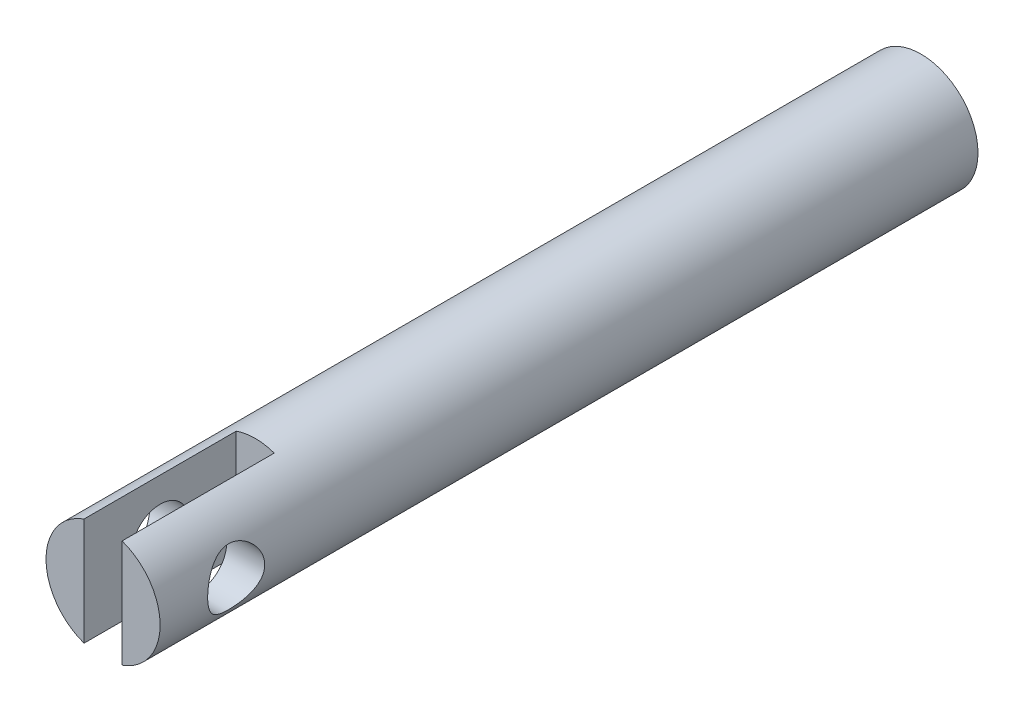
ISO-10303-21;
HEADER;
FILE_DESCRIPTION(('STEP AP214'),'2;1');
FILE_NAME('part.step','',(''),(''),'','','');
FILE_SCHEMA(('AUTOMOTIVE_DESIGN { 1 0 10303 214 1 1 1 1 }'));
ENDSEC;
DATA;
#1=APPLICATION_CONTEXT('core data for automotive mechanical design processes');
#2=APPLICATION_PROTOCOL_DEFINITION('international standard','automotive_design',2000,#1);
#3=PRODUCT_CONTEXT('',#1,'mechanical');
#4=PRODUCT('Part','Part','',(#3));
#5=PRODUCT_RELATED_PRODUCT_CATEGORY('part','',(#4));
#6=PRODUCT_DEFINITION_FORMATION('','',#4);
#7=PRODUCT_DEFINITION_CONTEXT('part definition',#1,'design');
#8=PRODUCT_DEFINITION('design','',#6,#7);
#9=PRODUCT_DEFINITION_SHAPE('','',#8);
#10=(LENGTH_UNIT() NAMED_UNIT(*) SI_UNIT(.MILLI.,.METRE.));
#11=(NAMED_UNIT(*) PLANE_ANGLE_UNIT() SI_UNIT($,.RADIAN.));
#12=(NAMED_UNIT(*) SI_UNIT($,.STERADIAN.) SOLID_ANGLE_UNIT());
#13=UNCERTAINTY_MEASURE_WITH_UNIT(LENGTH_MEASURE(1.E-05),#10,'distance_accuracy_value','');
#14=(GEOMETRIC_REPRESENTATION_CONTEXT(3) GLOBAL_UNCERTAINTY_ASSIGNED_CONTEXT((#13)) GLOBAL_UNIT_ASSIGNED_CONTEXT((#10,
#11,#12)) REPRESENTATION_CONTEXT('',''));
#15=CARTESIAN_POINT('',(0.,0.,0.));
#16=DIRECTION('',(0.,0.,1.));
#17=DIRECTION('',(1.,0.,0.));
#18=AXIS2_PLACEMENT_3D('',#15,#16,#17);
#19=CARTESIAN_POINT('',(0.,0.,68.2625));
#20=DIRECTION('',(0.,0.,1.));
#21=DIRECTION('',(1.,0.,0.));
#22=AXIS2_PLACEMENT_3D('',#19,#20,#21);
#23=PLANE('',#22);
#24=DIRECTION('',(0.,-1.,0.));
#25=VECTOR('',#24,1.);
#26=CARTESIAN_POINT('',(-1.5875,0.,68.2625));
#27=LINE('',#26,#25);
#28=CARTESIAN_POINT('',(-1.5875,4.49012806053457,68.2625));
#29=VERTEX_POINT('',#28);
#30=CARTESIAN_POINT('',(-1.5875,-4.49012806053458,68.2625));
#31=VERTEX_POINT('',#30);
#32=EDGE_CURVE('E152',#29,#31,#27,.T.);
#33=ORIENTED_EDGE('',*,*,#32,.F.);
#34=CARTESIAN_POINT('',(0.,0.,68.2625));
#35=DIRECTION('',(0.,0.,1.));
#36=DIRECTION('',(1.,0.,0.));
#37=AXIS2_PLACEMENT_3D('',#34,#35,#36);
#38=CIRCLE('',#37,4.7625);
#39=EDGE_CURVE('E154',#29,#31,#38,.T.);
#40=ORIENTED_EDGE('',*,*,#39,.T.);
#41=EDGE_LOOP('',(#33,#40));
#42=FACE_BOUND('',#41,.T.);
#43=ADVANCED_FACE('F36',(#42),#23,.T.);
#44=CARTESIAN_POINT('',(0.,0.,68.2625));
#45=DIRECTION('',(0.,0.,-1.));
#46=DIRECTION('',(-1.,0.,0.));
#47=AXIS2_PLACEMENT_3D('',#44,#45,#46);
#48=CYLINDRICAL_SURFACE('',#47,4.7625);
#49=CARTESIAN_POINT('',(-4.7625,0.,59.53125));
#50=CARTESIAN_POINT('',(-4.76249216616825,0.125183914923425,59.5312592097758));
#51=CARTESIAN_POINT('',(-4.75751079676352,0.250522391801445,59.5411803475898));
#52=CARTESIAN_POINT('',(-4.73807236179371,0.497492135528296,59.5804293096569));
#53=CARTESIAN_POINT('',(-4.72359730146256,0.619115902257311,59.6097939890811));
#54=CARTESIAN_POINT('',(-4.68668758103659,0.854710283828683,59.6864928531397));
#55=CARTESIAN_POINT('',(-4.66428387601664,0.968708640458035,59.733757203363));
#56=CARTESIAN_POINT('',(-4.6135713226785,1.18698797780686,59.8445525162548));
#57=CARTESIAN_POINT('',(-4.58526293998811,1.29126972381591,59.9080821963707));
#58=CARTESIAN_POINT('',(-4.52333339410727,1.49425297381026,60.0539754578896));
#59=CARTESIAN_POINT('',(-4.48949442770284,1.59223521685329,60.1372459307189));
#60=CARTESIAN_POINT('',(-4.42102804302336,1.77350605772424,60.318304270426));
#61=CARTESIAN_POINT('',(-4.3864000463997,1.85678345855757,60.4161030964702));
#62=CARTESIAN_POINT('',(-4.31718127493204,2.01275632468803,60.6325384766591));
#63=CARTESIAN_POINT('',(-4.2828016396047,2.08413032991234,60.7522028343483));
#64=CARTESIAN_POINT('',(-4.22162236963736,2.20543809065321,61.0037372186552));
#65=CARTESIAN_POINT('',(-4.19481732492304,2.25538716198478,61.1355984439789));
#66=CARTESIAN_POINT('',(-4.1542779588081,2.32917787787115,61.3997337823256));
#67=CARTESIAN_POINT('',(-4.13985721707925,2.35440344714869,61.5315106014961));
#68=CARTESIAN_POINT('',(-4.12389375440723,2.38226677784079,61.7981496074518));
#69=CARTESIAN_POINT('',(-4.12233830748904,2.38492686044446,61.9330086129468));
#70=CARTESIAN_POINT('',(-4.13172902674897,2.36859910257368,62.1846435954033));
#71=CARTESIAN_POINT('',(-4.14120243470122,2.35216198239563,62.3016534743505));
#72=CARTESIAN_POINT('',(-4.16900269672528,2.30252551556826,62.5309627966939));
#73=CARTESIAN_POINT('',(-4.1873323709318,2.26932082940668,62.6432607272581));
#74=CARTESIAN_POINT('',(-4.23118303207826,2.18648703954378,62.8631643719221));
#75=CARTESIAN_POINT('',(-4.25686158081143,2.13649337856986,62.9705998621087));
#76=CARTESIAN_POINT('',(-4.31252481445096,2.02178051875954,63.1760729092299));
#77=CARTESIAN_POINT('',(-4.3425114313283,1.95705470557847,63.2741062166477));
#78=CARTESIAN_POINT('',(-4.40800707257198,1.80514479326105,63.4710787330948));
#79=CARTESIAN_POINT('',(-4.44373421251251,1.71615367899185,63.5685566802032));
#80=CARTESIAN_POINT('',(-4.51360277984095,1.52294172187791,63.7478137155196));
#81=CARTESIAN_POINT('',(-4.54774344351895,1.41871364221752,63.8295853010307));
#82=CARTESIAN_POINT('',(-4.61252857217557,1.19185492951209,63.9786764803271));
#83=CARTESIAN_POINT('',(-4.64293706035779,1.0685944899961,64.0451486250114));
#84=CARTESIAN_POINT('',(-4.69482204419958,0.810735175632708,64.1558685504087));
#85=CARTESIAN_POINT('',(-4.71630562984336,0.676145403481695,64.2001339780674));
#86=CARTESIAN_POINT('',(-4.74641069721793,0.411400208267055,64.2615445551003));
#87=CARTESIAN_POINT('',(-4.75595009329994,0.281800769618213,64.280632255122));
#88=CARTESIAN_POINT('',(-4.7642386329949,0.0209064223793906,64.297237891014));
#89=CARTESIAN_POINT('',(-4.7629928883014,-0.110387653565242,64.294766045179));
#90=CARTESIAN_POINT('',(-4.75038401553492,-0.360123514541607,64.2694453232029));
#91=CARTESIAN_POINT('',(-4.73981253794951,-0.478772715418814,64.2481906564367));
#92=CARTESIAN_POINT('',(-4.71064045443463,-0.710581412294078,64.1884080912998));
#93=CARTESIAN_POINT('',(-4.69203896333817,-0.823740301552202,64.1498782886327));
#94=CARTESIAN_POINT('',(-4.64782498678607,-1.04510349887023,64.0556286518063));
#95=CARTESIAN_POINT('',(-4.62202724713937,-1.15307363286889,63.9994488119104));
#96=CARTESIAN_POINT('',(-4.56590338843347,-1.35841111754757,63.8720126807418));
#97=CARTESIAN_POINT('',(-4.53557534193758,-1.45577392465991,63.8007499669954));
#98=CARTESIAN_POINT('',(-4.46980202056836,-1.64727181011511,63.6370954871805));
#99=CARTESIAN_POINT('',(-4.4341466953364,-1.7401510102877,63.5433160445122));
#100=CARTESIAN_POINT('',(-4.36393570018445,-1.90942036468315,63.3414282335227));
#101=CARTESIAN_POINT('',(-4.32938080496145,-1.98579911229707,63.2333100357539));
#102=CARTESIAN_POINT('',(-4.2636565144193,-2.12337947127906,62.9991985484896));
#103=CARTESIAN_POINT('',(-4.23273211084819,-2.18366696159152,62.8725931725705));
#104=CARTESIAN_POINT('',(-4.18085759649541,-2.28143472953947,62.6089916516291));
#105=CARTESIAN_POINT('',(-4.15989464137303,-2.31894439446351,62.4720091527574));
#106=CARTESIAN_POINT('',(-4.13293324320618,-2.36663314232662,62.2056075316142));
#107=CARTESIAN_POINT('',(-4.12569144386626,-2.37909019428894,62.0767246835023));
#108=CARTESIAN_POINT('',(-4.12350000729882,-2.38289105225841,61.8185666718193));
#109=CARTESIAN_POINT('',(-4.12854504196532,-2.37424400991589,61.6892917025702));
#110=CARTESIAN_POINT('',(-4.14903909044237,-2.33821157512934,61.4470049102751));
#111=CARTESIAN_POINT('',(-4.16345118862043,-2.31268975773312,61.333616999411));
#112=CARTESIAN_POINT('',(-4.19983482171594,-2.24593636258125,61.1128569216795));
#113=CARTESIAN_POINT('',(-4.22180878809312,-2.2046997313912,61.0054867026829));
#114=CARTESIAN_POINT('',(-4.27264188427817,-2.10458608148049,60.7918245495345));
#115=CARTESIAN_POINT('',(-4.30186440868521,-2.04471002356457,60.6860897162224));
#116=CARTESIAN_POINT('',(-4.36329131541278,-1.91012262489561,60.4854776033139));
#117=CARTESIAN_POINT('',(-4.39549724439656,-1.83540356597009,60.3906060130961));
#118=CARTESIAN_POINT('',(-4.46394665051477,-1.66259405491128,60.2024240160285));
#119=CARTESIAN_POINT('',(-4.50020523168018,-1.56276696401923,60.1107039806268));
#120=CARTESIAN_POINT('',(-4.56908865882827,-1.34816645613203,59.9449628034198));
#121=CARTESIAN_POINT('',(-4.60171154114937,-1.23338503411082,59.8709512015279));
#122=CARTESIAN_POINT('',(-4.66006004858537,-0.990398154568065,59.7426126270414));
#123=CARTESIAN_POINT('',(-4.68573527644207,-0.862103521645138,59.6884285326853));
#124=CARTESIAN_POINT('',(-4.71657007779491,-0.663253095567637,59.6244198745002));
#125=CARTESIAN_POINT('',(-4.72556504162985,-0.595951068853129,59.6059684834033));
#126=CARTESIAN_POINT('',(-4.74075563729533,-0.459699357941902,59.575002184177));
#127=CARTESIAN_POINT('',(-4.74695297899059,-0.390750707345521,59.5624836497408));
#128=CARTESIAN_POINT('',(-4.75524386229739,-0.268146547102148,59.5457875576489));
#129=CARTESIAN_POINT('',(-4.75795932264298,-0.214701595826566,59.5403416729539));
#130=CARTESIAN_POINT('',(-4.761589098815,-0.107513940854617,59.5330708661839));
#131=CARTESIAN_POINT('',(-4.76250336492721,-0.0537712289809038,59.5312460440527));
#132=CARTESIAN_POINT('',(-4.7625,0.,59.53125));
#133=B_SPLINE_CURVE_WITH_KNOTS('',3,(#49,#50,#51,#52,#53,#54,#55,#56,#57,#58,#59,#60,#61,#62,
#63,#64,#65,#66,#67,#68,#69,#70,#71,#72,#73,#74,#75,#76,#77,#78,#79,#80,#81,#82,#83,#84,#85,#86,
#87,#88,#89,#90,#91,#92,#93,#94,#95,#96,#97,#98,#99,#100,#101,#102,#103,#104,#105,#106,#107,
#108,#109,#110,#111,#112,#113,#114,#115,#116,#117,#118,#119,#120,#121,#122,#123,#124,#125,#126,
#127,#128,#129,#130,#131,#132),.UNSPECIFIED.,.T.,.F.,(4,2,2,2,2,2,2,2,2,2,2,2,2,2,2,2,2,2,2,2,2,
2,2,2,2,2,2,2,2,2,2,2,2,2,2,2,2,2,2,2,2,4),(0.,0.375342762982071,0.751399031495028,
1.12600300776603,1.50057745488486,1.89781281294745,2.29534935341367,2.7237148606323,
3.15177363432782,3.55420641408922,3.95624107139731,4.31019852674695,4.66426876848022,
5.02658634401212,5.38906691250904,5.79750891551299,6.20614554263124,6.63375821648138,
7.06103054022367,7.45291460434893,7.84461294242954,8.20595196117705,8.56733082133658,
8.93904238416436,9.31091254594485,9.71930072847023,10.127970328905,10.5564308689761,
10.9843374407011,11.3711666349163,11.7578281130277,12.1076544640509,12.4575934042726,
12.8310431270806,13.2046875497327,13.6237323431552,14.0430023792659,14.4652368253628,
14.6760580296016,14.8867502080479,15.0479696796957,15.2091936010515),.UNSPECIFIED.);
#134=CARTESIAN_POINT('',(-4.7625,0.,59.53125));
#135=VERTEX_POINT('',#134);
#136=EDGE_CURVE('E111',#135,#135,#133,.T.);
#137=ORIENTED_EDGE('',*,*,#136,.T.);
#138=EDGE_LOOP('',(#137));
#139=FACE_BOUND('',#138,.T.);
#140=CARTESIAN_POINT('',(4.7625,0.,59.53125));
#141=CARTESIAN_POINT('',(4.76249216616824,-0.125183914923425,59.5312592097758));
#142=CARTESIAN_POINT('',(4.75751079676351,-0.250522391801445,59.5411803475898));
#143=CARTESIAN_POINT('',(4.73807236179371,-0.497492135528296,59.5804293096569));
#144=CARTESIAN_POINT('',(4.72359730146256,-0.619115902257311,59.6097939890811));
#145=CARTESIAN_POINT('',(4.68668758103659,-0.854710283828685,59.6864928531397));
#146=CARTESIAN_POINT('',(4.66428387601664,-0.968708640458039,59.733757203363));
#147=CARTESIAN_POINT('',(4.6135713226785,-1.18698797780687,59.8445525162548));
#148=CARTESIAN_POINT('',(4.58526293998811,-1.29126972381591,59.9080821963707));
#149=CARTESIAN_POINT('',(4.52333339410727,-1.49425297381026,60.0539754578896));
#150=CARTESIAN_POINT('',(4.48949442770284,-1.59223521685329,60.1372459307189));
#151=CARTESIAN_POINT('',(4.42102804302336,-1.77350605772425,60.318304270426));
#152=CARTESIAN_POINT('',(4.38640004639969,-1.85678345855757,60.4161030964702));
#153=CARTESIAN_POINT('',(4.31718127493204,-2.01275632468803,60.6325384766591));
#154=CARTESIAN_POINT('',(4.28280163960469,-2.08413032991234,60.7522028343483));
#155=CARTESIAN_POINT('',(4.22162236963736,-2.20543809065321,61.0037372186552));
#156=CARTESIAN_POINT('',(4.19481732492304,-2.25538716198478,61.1355984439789));
#157=CARTESIAN_POINT('',(4.1542779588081,-2.32917787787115,61.3997337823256));
#158=CARTESIAN_POINT('',(4.13985721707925,-2.35440344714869,61.5315106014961));
#159=CARTESIAN_POINT('',(4.12389375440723,-2.38226677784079,61.7981496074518));
#160=CARTESIAN_POINT('',(4.12233830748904,-2.38492686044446,61.9330086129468));
#161=CARTESIAN_POINT('',(4.13172902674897,-2.36859910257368,62.1846435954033));
#162=CARTESIAN_POINT('',(4.14120243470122,-2.35216198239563,62.3016534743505));
#163=CARTESIAN_POINT('',(4.16900269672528,-2.30252551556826,62.5309627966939));
#164=CARTESIAN_POINT('',(4.1873323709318,-2.26932082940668,62.6432607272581));
#165=CARTESIAN_POINT('',(4.23118303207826,-2.18648703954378,62.8631643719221));
#166=CARTESIAN_POINT('',(4.25686158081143,-2.13649337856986,62.9705998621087));
#167=CARTESIAN_POINT('',(4.31252481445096,-2.02178051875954,63.1760729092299));
#168=CARTESIAN_POINT('',(4.3425114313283,-1.95705470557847,63.2741062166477));
#169=CARTESIAN_POINT('',(4.40800707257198,-1.80514479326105,63.4710787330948));
#170=CARTESIAN_POINT('',(4.44373421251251,-1.71615367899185,63.5685566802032));
#171=CARTESIAN_POINT('',(4.51360277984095,-1.52294172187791,63.7478137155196));
#172=CARTESIAN_POINT('',(4.54774344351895,-1.41871364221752,63.8295853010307));
#173=CARTESIAN_POINT('',(4.61252857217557,-1.19185492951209,63.978676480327));
#174=CARTESIAN_POINT('',(4.6429370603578,-1.0685944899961,64.0451486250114));
#175=CARTESIAN_POINT('',(4.69482204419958,-0.810735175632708,64.1558685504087));
#176=CARTESIAN_POINT('',(4.71630562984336,-0.676145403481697,64.2001339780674));
#177=CARTESIAN_POINT('',(4.74641069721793,-0.411400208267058,64.2615445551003));
#178=CARTESIAN_POINT('',(4.75595009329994,-0.281800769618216,64.280632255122));
#179=CARTESIAN_POINT('',(4.7642386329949,-0.0209064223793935,64.297237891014));
#180=CARTESIAN_POINT('',(4.7629928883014,0.110387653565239,64.294766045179));
#181=CARTESIAN_POINT('',(4.75038401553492,0.360123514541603,64.2694453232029));
#182=CARTESIAN_POINT('',(4.73981253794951,0.47877271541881,64.2481906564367));
#183=CARTESIAN_POINT('',(4.71064045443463,0.710581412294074,64.1884080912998));
#184=CARTESIAN_POINT('',(4.69203896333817,0.823740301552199,64.1498782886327));
#185=CARTESIAN_POINT('',(4.64782498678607,1.04510349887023,64.0556286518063));
#186=CARTESIAN_POINT('',(4.62202724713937,1.15307363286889,63.9994488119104));
#187=CARTESIAN_POINT('',(4.56590338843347,1.35841111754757,63.8720126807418));
#188=CARTESIAN_POINT('',(4.53557534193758,1.45577392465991,63.8007499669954));
#189=CARTESIAN_POINT('',(4.46980202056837,1.64727181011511,63.6370954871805));
#190=CARTESIAN_POINT('',(4.43414669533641,1.7401510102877,63.5433160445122));
#191=CARTESIAN_POINT('',(4.36393570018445,1.90942036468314,63.3414282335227));
#192=CARTESIAN_POINT('',(4.32938080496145,1.98579911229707,63.2333100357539));
#193=CARTESIAN_POINT('',(4.2636565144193,2.12337947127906,62.9991985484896));
#194=CARTESIAN_POINT('',(4.23273211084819,2.18366696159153,62.8725931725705));
#195=CARTESIAN_POINT('',(4.18085759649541,2.28143472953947,62.6089916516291));
#196=CARTESIAN_POINT('',(4.15989464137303,2.31894439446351,62.4720091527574));
#197=CARTESIAN_POINT('',(4.13293324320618,2.36663314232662,62.2056075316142));
#198=CARTESIAN_POINT('',(4.12569144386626,2.37909019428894,62.0767246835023));
#199=CARTESIAN_POINT('',(4.12350000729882,2.38289105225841,61.8185666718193));
#200=CARTESIAN_POINT('',(4.12854504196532,2.37424400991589,61.6892917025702));
#201=CARTESIAN_POINT('',(4.14903909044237,2.33821157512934,61.4470049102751));
#202=CARTESIAN_POINT('',(4.16345118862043,2.31268975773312,61.333616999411));
#203=CARTESIAN_POINT('',(4.19983482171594,2.24593636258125,61.1128569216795));
#204=CARTESIAN_POINT('',(4.22180878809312,2.2046997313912,61.0054867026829));
#205=CARTESIAN_POINT('',(4.27264188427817,2.10458608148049,60.7918245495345));
#206=CARTESIAN_POINT('',(4.30186440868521,2.04471002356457,60.6860897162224));
#207=CARTESIAN_POINT('',(4.36329131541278,1.91012262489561,60.4854776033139));
#208=CARTESIAN_POINT('',(4.39549724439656,1.8354035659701,60.3906060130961));
#209=CARTESIAN_POINT('',(4.46394665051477,1.66259405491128,60.2024240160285));
#210=CARTESIAN_POINT('',(4.50020523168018,1.56276696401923,60.1107039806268));
#211=CARTESIAN_POINT('',(4.56908865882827,1.34816645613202,59.9449628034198));
#212=CARTESIAN_POINT('',(4.60171154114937,1.23338503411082,59.8709512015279));
#213=CARTESIAN_POINT('',(4.66006004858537,0.990398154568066,59.7426126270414));
#214=CARTESIAN_POINT('',(4.68573527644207,0.862103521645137,59.6884285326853));
#215=CARTESIAN_POINT('',(4.71657007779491,0.663253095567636,59.6244198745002));
#216=CARTESIAN_POINT('',(4.72556504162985,0.595951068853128,59.6059684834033));
#217=CARTESIAN_POINT('',(4.74075563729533,0.459699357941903,59.575002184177));
#218=CARTESIAN_POINT('',(4.74695297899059,0.390750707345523,59.5624836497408));
#219=CARTESIAN_POINT('',(4.75524386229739,0.268146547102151,59.5457875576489));
#220=CARTESIAN_POINT('',(4.75795932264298,0.214701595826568,59.5403416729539));
#221=CARTESIAN_POINT('',(4.761589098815,0.107513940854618,59.5330708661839));
#222=CARTESIAN_POINT('',(4.7625033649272,0.0537712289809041,59.5312460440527));
#223=CARTESIAN_POINT('',(4.7625,0.,59.53125));
#224=B_SPLINE_CURVE_WITH_KNOTS('',3,(#140,#141,#142,#143,#144,#145,#146,#147,#148,#149,#150,
#151,#152,#153,#154,#155,#156,#157,#158,#159,#160,#161,#162,#163,#164,#165,#166,#167,#168,#169,
#170,#171,#172,#173,#174,#175,#176,#177,#178,#179,#180,#181,#182,#183,#184,#185,#186,#187,#188,
#189,#190,#191,#192,#193,#194,#195,#196,#197,#198,#199,#200,#201,#202,#203,#204,#205,#206,#207,
#208,#209,#210,#211,#212,#213,#214,#215,#216,#217,#218,#219,#220,#221,#222,#223),.UNSPECIFIED.,
.T.,.F.,(4,2,2,2,2,2,2,2,2,2,2,2,2,2,2,2,2,2,2,2,2,2,2,2,2,2,2,2,2,2,2,2,2,2,2,2,2,2,2,2,2,4),
(0.,0.375342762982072,0.751399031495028,1.12600300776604,1.50057745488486,1.89781281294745,
2.29534935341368,2.72371486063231,3.15177363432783,3.55420641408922,3.9562410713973,
4.31019852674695,4.66426876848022,5.02658634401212,5.38906691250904,5.79750891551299,
6.20614554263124,6.63375821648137,7.06103054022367,7.45291460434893,7.84461294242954,
8.20595196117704,8.56733082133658,8.93904238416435,9.31091254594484,9.71930072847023,
10.127970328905,10.5564308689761,10.9843374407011,11.3711666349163,11.7578281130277,
12.1076544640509,12.4575934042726,12.8310431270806,13.2046875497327,13.6237323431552,
14.0430023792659,14.4652368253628,14.6760580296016,14.8867502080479,15.0479696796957,
15.2091936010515),.UNSPECIFIED.);
#225=CARTESIAN_POINT('',(4.7625,0.,59.53125));
#226=VERTEX_POINT('',#225);
#227=EDGE_CURVE('E105',#226,#226,#224,.T.);
#228=ORIENTED_EDGE('',*,*,#227,.T.);
#229=EDGE_LOOP('',(#228));
#230=FACE_BOUND('',#229,.T.);
#231=ORIENTED_EDGE('',*,*,#39,.F.);
#232=DIRECTION('',(0.,0.,-1.));
#233=VECTOR('',#232,1.);
#234=CARTESIAN_POINT('',(-1.5875,4.49012806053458,68.2625));
#235=LINE('',#234,#233);
#236=CARTESIAN_POINT('',(-1.58749999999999,4.49012806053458,55.5625));
#237=VERTEX_POINT('',#236);
#238=EDGE_CURVE('E162',#29,#237,#235,.T.);
#239=ORIENTED_EDGE('',*,*,#238,.T.);
#240=CARTESIAN_POINT('',(0.,0.,55.5625));
#241=DIRECTION('',(0.,0.,-1.));
#242=DIRECTION('',(-1.,0.,0.));
#243=AXIS2_PLACEMENT_3D('',#240,#241,#242);
#244=CIRCLE('',#243,4.7625);
#245=CARTESIAN_POINT('',(1.58750000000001,4.49012806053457,55.5625));
#246=VERTEX_POINT('',#245);
#247=EDGE_CURVE('E46',#237,#246,#244,.T.);
#248=ORIENTED_EDGE('',*,*,#247,.T.);
#249=DIRECTION('',(0.,0.,-1.));
#250=VECTOR('',#249,1.);
#251=CARTESIAN_POINT('',(1.58750000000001,4.49012806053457,68.2625));
#252=LINE('',#251,#250);
#253=CARTESIAN_POINT('',(1.58750000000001,4.49012806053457,68.2625));
#254=VERTEX_POINT('',#253);
#255=EDGE_CURVE('E173',#246,#254,#252,.F.);
#256=ORIENTED_EDGE('',*,*,#255,.T.);
#257=CARTESIAN_POINT('',(1.58750000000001,-4.49012806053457,68.2625));
#258=VERTEX_POINT('',#257);
#259=EDGE_CURVE('E164',#258,#254,#38,.T.);
#260=ORIENTED_EDGE('',*,*,#259,.F.);
#261=DIRECTION('',(0.,0.,-1.));
#262=VECTOR('',#261,1.);
#263=CARTESIAN_POINT('',(1.58750000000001,-4.49012806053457,68.2625));
#264=LINE('',#263,#262);
#265=CARTESIAN_POINT('',(1.58750000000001,-4.49012806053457,55.5625));
#266=VERTEX_POINT('',#265);
#267=EDGE_CURVE('E53',#258,#266,#264,.T.);
#268=ORIENTED_EDGE('',*,*,#267,.T.);
#269=CARTESIAN_POINT('',(-1.58749999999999,-4.49012806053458,55.5625));
#270=VERTEX_POINT('',#269);
#271=EDGE_CURVE('E11',#266,#270,#244,.T.);
#272=ORIENTED_EDGE('',*,*,#271,.T.);
#273=DIRECTION('',(0.,0.,-1.));
#274=VECTOR('',#273,1.);
#275=CARTESIAN_POINT('',(-1.5875,-4.49012806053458,68.2625));
#276=LINE('',#275,#274);
#277=EDGE_CURVE('E163',#270,#31,#276,.F.);
#278=ORIENTED_EDGE('',*,*,#277,.T.);
#279=EDGE_LOOP('',(#231,#239,#248,#256,#260,#268,#272,#278));
#280=FACE_BOUND('',#279,.T.);
#281=CARTESIAN_POINT('',(0.,0.,0.));
#282=DIRECTION('',(0.,0.,1.));
#283=DIRECTION('',(1.,0.,0.));
#284=AXIS2_PLACEMENT_3D('',#281,#282,#283);
#285=CIRCLE('',#284,4.7625);
#286=CARTESIAN_POINT('',(4.7625,0.,0.));
#287=VERTEX_POINT('',#286);
#288=EDGE_CURVE('E168',#287,#287,#285,.T.);
#289=ORIENTED_EDGE('',*,*,#288,.T.);
#290=EDGE_LOOP('',(#289));
#291=FACE_BOUND('',#290,.T.);
#292=ADVANCED_FACE('F38',(#139,#230,#280,#291),#48,.T.);
#293=DIRECTION('',(0.,1.,0.));
#294=VECTOR('',#293,1.);
#295=CARTESIAN_POINT('',(1.58750000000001,0.,68.2625));
#296=LINE('',#295,#294);
#297=EDGE_CURVE('E157',#258,#254,#296,.T.);
#298=ORIENTED_EDGE('',*,*,#297,.F.);
#299=ORIENTED_EDGE('',*,*,#259,.T.);
#300=EDGE_LOOP('',(#298,#299));
#301=FACE_BOUND('',#300,.T.);
#302=ADVANCED_FACE('F138',(#301),#23,.T.);
#303=CARTESIAN_POINT('',(0.,0.,0.));
#304=DIRECTION('',(0.,0.,1.));
#305=DIRECTION('',(1.,0.,0.));
#306=AXIS2_PLACEMENT_3D('',#303,#304,#305);
#307=PLANE('',#306);
#308=CARTESIAN_POINT('',(0.,0.,0.));
#309=DIRECTION('',(0.,0.,-1.));
#310=DIRECTION('',(-1.,0.,0.));
#311=AXIS2_PLACEMENT_3D('',#308,#309,#310);
#312=CIRCLE('',#311,2.413);
#313=CARTESIAN_POINT('',(-2.413,0.,0.));
#314=VERTEX_POINT('',#313);
#315=EDGE_CURVE('E99',#314,#314,#312,.T.);
#316=ORIENTED_EDGE('',*,*,#315,.F.);
#317=EDGE_LOOP('',(#316));
#318=FACE_BOUND('',#317,.T.);
#319=ORIENTED_EDGE('',*,*,#288,.F.);
#320=EDGE_LOOP('',(#319));
#321=FACE_BOUND('',#320,.T.);
#322=ADVANCED_FACE('F129',(#318,#321),#307,.F.);
#323=CARTESIAN_POINT('',(-1.58749999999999,-4.7625,55.5625));
#324=DIRECTION('',(0.,0.,-1.));
#325=DIRECTION('',(-1.,0.,0.));
#326=AXIS2_PLACEMENT_3D('',#323,#324,#325);
#327=PLANE('',#326);
#328=DIRECTION('',(0.,1.,0.));
#329=VECTOR('',#328,1.);
#330=CARTESIAN_POINT('',(-1.58749999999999,-4.7625,55.5625));
#331=LINE('',#330,#329);
#332=EDGE_CURVE('E174',#270,#237,#331,.T.);
#333=ORIENTED_EDGE('',*,*,#332,.F.);
#334=ORIENTED_EDGE('',*,*,#271,.F.);
#335=DIRECTION('',(0.,1.,0.));
#336=VECTOR('',#335,1.);
#337=CARTESIAN_POINT('',(1.58750000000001,-4.7625,55.5625));
#338=LINE('',#337,#336);
#339=EDGE_CURVE('E177',#266,#246,#338,.T.);
#340=ORIENTED_EDGE('',*,*,#339,.T.);
#341=ORIENTED_EDGE('',*,*,#247,.F.);
#342=EDGE_LOOP('',(#333,#334,#340,#341));
#343=FACE_BOUND('',#342,.T.);
#344=ADVANCED_FACE('F124',(#343),#327,.F.);
#345=CARTESIAN_POINT('',(-1.5875,-4.7625,68.2625));
#346=DIRECTION('',(-1.,0.,0.));
#347=DIRECTION('',(0.,0.,1.));
#348=AXIS2_PLACEMENT_3D('',#345,#346,#347);
#349=PLANE('',#348);
#350=CARTESIAN_POINT('',(-1.58749999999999,0.,61.9125));
#351=DIRECTION('',(-1.,0.,0.));
#352=DIRECTION('',(0.,0.,1.));
#353=AXIS2_PLACEMENT_3D('',#350,#351,#352);
#354=CIRCLE('',#353,2.38125000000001);
#355=CARTESIAN_POINT('',(-1.58749999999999,0.,64.29375));
#356=VERTEX_POINT('',#355);
#357=EDGE_CURVE('E102',#356,#356,#354,.T.);
#358=ORIENTED_EDGE('',*,*,#357,.T.);
#359=EDGE_LOOP('',(#358));
#360=FACE_BOUND('',#359,.T.);
#361=ORIENTED_EDGE('',*,*,#32,.T.);
#362=ORIENTED_EDGE('',*,*,#277,.F.);
#363=ORIENTED_EDGE('',*,*,#332,.T.);
#364=ORIENTED_EDGE('',*,*,#238,.F.);
#365=EDGE_LOOP('',(#361,#362,#363,#364));
#366=FACE_BOUND('',#365,.T.);
#367=ADVANCED_FACE('F128',(#360,#366),#349,.F.);
#368=CARTESIAN_POINT('',(1.58750000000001,-4.7625,68.2625));
#369=DIRECTION('',(1.,0.,0.));
#370=DIRECTION('',(0.,0.,-1.));
#371=AXIS2_PLACEMENT_3D('',#368,#369,#370);
#372=PLANE('',#371);
#373=CARTESIAN_POINT('',(1.58750000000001,0.,61.9125));
#374=DIRECTION('',(1.,0.,0.));
#375=DIRECTION('',(0.,0.,-1.));
#376=AXIS2_PLACEMENT_3D('',#373,#374,#375);
#377=CIRCLE('',#376,2.38125000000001);
#378=CARTESIAN_POINT('',(1.58750000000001,0.,59.53125));
#379=VERTEX_POINT('',#378);
#380=EDGE_CURVE('E41',#379,#379,#377,.T.);
#381=ORIENTED_EDGE('',*,*,#380,.T.);
#382=EDGE_LOOP('',(#381));
#383=FACE_BOUND('',#382,.T.);
#384=ORIENTED_EDGE('',*,*,#297,.T.);
#385=ORIENTED_EDGE('',*,*,#255,.F.);
#386=ORIENTED_EDGE('',*,*,#339,.F.);
#387=ORIENTED_EDGE('',*,*,#267,.F.);
#388=EDGE_LOOP('',(#384,#385,#386,#387));
#389=FACE_BOUND('',#388,.T.);
#390=ADVANCED_FACE('F130',(#383,#389),#372,.F.);
#391=CARTESIAN_POINT('',(-4.7625,0.,61.9125));
#392=DIRECTION('',(1.,0.,0.));
#393=DIRECTION('',(0.,0.,-1.));
#394=AXIS2_PLACEMENT_3D('',#391,#392,#393);
#395=CYLINDRICAL_SURFACE('',#394,2.38125000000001);
#396=ORIENTED_EDGE('',*,*,#380,.F.);
#397=EDGE_LOOP('',(#396));
#398=FACE_BOUND('',#397,.T.);
#399=ORIENTED_EDGE('',*,*,#227,.F.);
#400=EDGE_LOOP('',(#399));
#401=FACE_BOUND('',#400,.T.);
#402=ADVANCED_FACE('F121',(#398,#401),#395,.F.);
#403=ORIENTED_EDGE('',*,*,#357,.F.);
#404=EDGE_LOOP('',(#403));
#405=FACE_BOUND('',#404,.T.);
#406=ORIENTED_EDGE('',*,*,#136,.F.);
#407=EDGE_LOOP('',(#406));
#408=FACE_BOUND('',#407,.T.);
#409=ADVANCED_FACE('F115',(#405,#408),#395,.F.);
#410=CARTESIAN_POINT('',(0.,0.,0.));
#411=DIRECTION('',(0.,0.,-1.));
#412=DIRECTION('',(-1.,0.,0.));
#413=AXIS2_PLACEMENT_3D('',#410,#411,#412);
#414=CYLINDRICAL_SURFACE('',#413,2.413);
#415=CARTESIAN_POINT('',(0.,0.,12.7));
#416=DIRECTION('',(0.,0.,-1.));
#417=DIRECTION('',(-1.,0.,0.));
#418=AXIS2_PLACEMENT_3D('',#415,#416,#417);
#419=CIRCLE('',#418,2.413);
#420=CARTESIAN_POINT('',(-2.413,0.,12.7));
#421=VERTEX_POINT('',#420);
#422=EDGE_CURVE('E94',#421,#421,#419,.T.);
#423=ORIENTED_EDGE('',*,*,#422,.F.);
#424=EDGE_LOOP('',(#423));
#425=FACE_BOUND('',#424,.T.);
#426=ORIENTED_EDGE('',*,*,#315,.T.);
#427=EDGE_LOOP('',(#426));
#428=FACE_BOUND('',#427,.T.);
#429=ADVANCED_FACE('F120',(#425,#428),#414,.F.);
#430=CARTESIAN_POINT('',(2.0193,0.,12.7));
#431=DIRECTION('',(0.,0.,1.));
#432=DIRECTION('',(1.,0.,0.));
#433=AXIS2_PLACEMENT_3D('',#430,#431,#432);
#434=PLANE('',#433);
#435=CARTESIAN_POINT('',(0.,0.,12.7));
#436=DIRECTION('',(0.,0.,-1.));
#437=DIRECTION('',(-1.,0.,0.));
#438=AXIS2_PLACEMENT_3D('',#435,#436,#437);
#439=CIRCLE('',#438,2.0193);
#440=CARTESIAN_POINT('',(-2.0193,0.,12.7));
#441=VERTEX_POINT('',#440);
#442=EDGE_CURVE('E91',#441,#441,#439,.T.);
#443=ORIENTED_EDGE('',*,*,#442,.F.);
#444=EDGE_LOOP('',(#443));
#445=FACE_BOUND('',#444,.T.);
#446=ORIENTED_EDGE('',*,*,#422,.T.);
#447=EDGE_LOOP('',(#446));
#448=FACE_BOUND('',#447,.T.);
#449=ADVANCED_FACE('F207',(#445,#448),#434,.F.);
#450=CARTESIAN_POINT('',(0.,0.,0.));
#451=DIRECTION('',(0.,0.,-1.));
#452=DIRECTION('',(-1.,0.,0.));
#453=AXIS2_PLACEMENT_3D('',#450,#451,#452);
#454=CYLINDRICAL_SURFACE('',#453,2.0193);
#455=CARTESIAN_POINT('',(0.,0.,15.07744));
#456=DIRECTION('',(0.,0.,-1.));
#457=DIRECTION('',(-1.,0.,0.));
#458=AXIS2_PLACEMENT_3D('',#455,#456,#457);
#459=CIRCLE('',#458,2.0193);
#460=CARTESIAN_POINT('',(-2.0193,0.,15.07744));
#461=VERTEX_POINT('',#460);
#462=EDGE_CURVE('E89',#461,#461,#459,.T.);
#463=ORIENTED_EDGE('',*,*,#462,.F.);
#464=EDGE_LOOP('',(#463));
#465=FACE_BOUND('',#464,.T.);
#466=ORIENTED_EDGE('',*,*,#442,.T.);
#467=EDGE_LOOP('',(#466));
#468=FACE_BOUND('',#467,.T.);
#469=ADVANCED_FACE('F85',(#465,#468),#454,.F.);
#470=CARTESIAN_POINT('',(0.,0.,15.07744));
#471=DIRECTION('',(0.,0.,-1.));
#472=DIRECTION('',(-1.,0.,0.));
#473=AXIS2_PLACEMENT_3D('',#470,#471,#472);
#474=CONICAL_SURFACE('',#473,2.0193,1.02974425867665);
#475=CARTESIAN_POINT('',(0.,0.,16.2907578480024));
#476=VERTEX_POINT('',#475);
#477=VERTEX_LOOP('',#476);
#478=FACE_BOUND('',#477,.T.);
#479=ORIENTED_EDGE('',*,*,#462,.T.);
#480=EDGE_LOOP('',(#479));
#481=FACE_BOUND('',#480,.T.);
#482=ADVANCED_FACE('F82',(#478,#481),#474,.F.);
#483=CLOSED_SHELL('',(#43,#292,#302,#322,#344,#367,#390,#402,#409,#429,#449,#469,#482));
#484=MANIFOLD_SOLID_BREP('B2',#483);
#485=ADVANCED_BREP_SHAPE_REPRESENTATION('',(#18,#484),#14);
#486=SHAPE_DEFINITION_REPRESENTATION(#9,#485);
ENDSEC;
END-ISO-10303-21;
